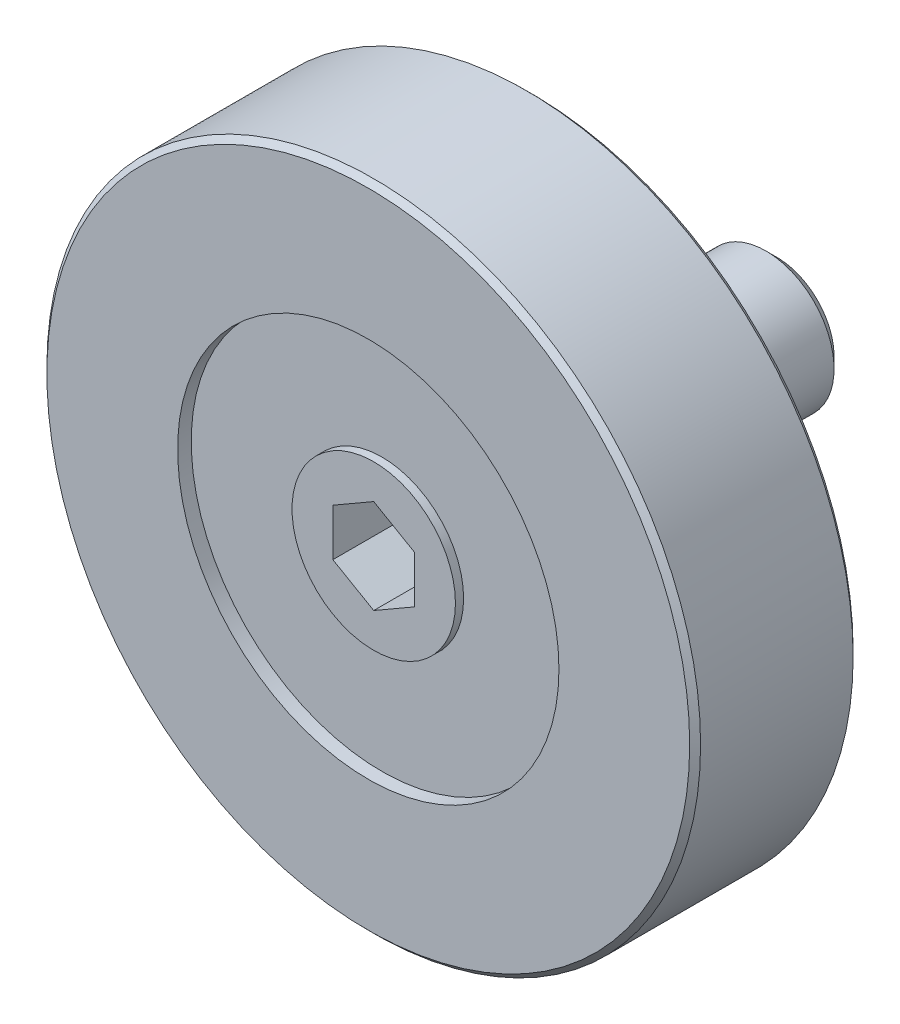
ISO-10303-21;
HEADER;
FILE_DESCRIPTION(('STEP AP214'),'2;1');
FILE_NAME('part.step','',(''),(''),'','','');
FILE_SCHEMA(('AUTOMOTIVE_DESIGN { 1 0 10303 214 1 1 1 1 }'));
ENDSEC;
DATA;
#1=APPLICATION_CONTEXT('core data for automotive mechanical design processes');
#2=APPLICATION_PROTOCOL_DEFINITION('international standard','automotive_design',2000,#1);
#3=PRODUCT_CONTEXT('',#1,'mechanical');
#4=PRODUCT('Part','Part','',(#3));
#5=PRODUCT_RELATED_PRODUCT_CATEGORY('part','',(#4));
#6=PRODUCT_DEFINITION_FORMATION('','',#4);
#7=PRODUCT_DEFINITION_CONTEXT('part definition',#1,'design');
#8=PRODUCT_DEFINITION('design','',#6,#7);
#9=PRODUCT_DEFINITION_SHAPE('','',#8);
#10=(LENGTH_UNIT() NAMED_UNIT(*) SI_UNIT(.MILLI.,.METRE.));
#11=(NAMED_UNIT(*) PLANE_ANGLE_UNIT() SI_UNIT($,.RADIAN.));
#12=(NAMED_UNIT(*) SI_UNIT($,.STERADIAN.) SOLID_ANGLE_UNIT());
#13=UNCERTAINTY_MEASURE_WITH_UNIT(LENGTH_MEASURE(1.E-05),#10,'distance_accuracy_value','');
#14=(GEOMETRIC_REPRESENTATION_CONTEXT(3) GLOBAL_UNCERTAINTY_ASSIGNED_CONTEXT((#13)) GLOBAL_UNIT_ASSIGNED_CONTEXT((#10,
#11,#12)) REPRESENTATION_CONTEXT('',''));
#15=CARTESIAN_POINT('',(0.,0.,0.));
#16=DIRECTION('',(0.,0.,1.));
#17=DIRECTION('',(1.,0.,0.));
#18=AXIS2_PLACEMENT_3D('',#15,#16,#17);
#19=CARTESIAN_POINT('',(0.,3.99999999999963,-3.05311331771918E-13));
#20=DIRECTION('',(0.,0.,1.));
#21=DIRECTION('',(1.,0.,0.));
#22=AXIS2_PLACEMENT_3D('',#19,#20,#21);
#23=PLANE('',#22);
#24=CARTESIAN_POINT('',(0.,0.,-3.05311331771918E-13));
#25=DIRECTION('',(0.,0.,1.));
#26=DIRECTION('',(1.,0.,0.));
#27=AXIS2_PLACEMENT_3D('',#24,#25,#26);
#28=CIRCLE('',#27,3.99999999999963);
#29=CARTESIAN_POINT('',(3.99999999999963,0.,-3.05311331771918E-13));
#30=VERTEX_POINT('',#29);
#31=EDGE_CURVE('E9',#30,#30,#28,.T.);
#32=ORIENTED_EDGE('',*,*,#31,.F.);
#33=EDGE_LOOP('',(#32));
#34=FACE_BOUND('',#33,.T.);
#35=CARTESIAN_POINT('',(0.,0.,-3.05311331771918E-13));
#36=DIRECTION('',(0.,0.,-1.));
#37=DIRECTION('',(-1.,0.,0.));
#38=AXIS2_PLACEMENT_3D('',#35,#36,#37);
#39=CIRCLE('',#38,2.);
#40=CARTESIAN_POINT('',(-2.,0.,-3.05311331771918E-13));
#41=VERTEX_POINT('',#40);
#42=EDGE_CURVE('E104',#41,#41,#39,.T.);
#43=ORIENTED_EDGE('',*,*,#42,.F.);
#44=EDGE_LOOP('',(#43));
#45=FACE_BOUND('',#44,.T.);
#46=ADVANCED_FACE('F14',(#34,#45),#23,.F.);
#47=CARTESIAN_POINT('',(0.,0.,10.));
#48=DIRECTION('',(0.,0.,1.));
#49=DIRECTION('',(1.,0.,0.));
#50=AXIS2_PLACEMENT_3D('',#47,#48,#49);
#51=CYLINDRICAL_SURFACE('',#50,3.99999999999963);
#52=CARTESIAN_POINT('',(0.,0.,1.49999999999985));
#53=DIRECTION('',(0.,0.,1.));
#54=DIRECTION('',(1.,0.,0.));
#55=AXIS2_PLACEMENT_3D('',#52,#53,#54);
#56=CIRCLE('',#55,3.99999999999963);
#57=CARTESIAN_POINT('',(3.99999999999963,0.,1.49999999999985));
#58=VERTEX_POINT('',#57);
#59=EDGE_CURVE('E22',#58,#58,#56,.T.);
#60=ORIENTED_EDGE('',*,*,#59,.F.);
#61=EDGE_LOOP('',(#60));
#62=FACE_BOUND('',#61,.T.);
#63=ORIENTED_EDGE('',*,*,#31,.T.);
#64=EDGE_LOOP('',(#63));
#65=FACE_BOUND('',#64,.T.);
#66=ADVANCED_FACE('F156',(#62,#65),#51,.T.);
#67=CARTESIAN_POINT('',(0.,3.99999999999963,1.49999999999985));
#68=DIRECTION('',(0.,0.,1.));
#69=DIRECTION('',(1.,0.,0.));
#70=AXIS2_PLACEMENT_3D('',#67,#68,#69);
#71=PLANE('',#70);
#72=CARTESIAN_POINT('',(0.,0.,1.49999999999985));
#73=DIRECTION('',(0.,0.,1.));
#74=DIRECTION('',(1.,0.,0.));
#75=AXIS2_PLACEMENT_3D('',#72,#73,#74);
#76=CIRCLE('',#75,6.99999999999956);
#77=CARTESIAN_POINT('',(6.99999999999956,0.,1.49999999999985));
#78=VERTEX_POINT('',#77);
#79=EDGE_CURVE('E149',#78,#78,#76,.T.);
#80=ORIENTED_EDGE('',*,*,#79,.F.);
#81=EDGE_LOOP('',(#80));
#82=FACE_BOUND('',#81,.T.);
#83=ORIENTED_EDGE('',*,*,#59,.T.);
#84=EDGE_LOOP('',(#83));
#85=FACE_BOUND('',#84,.T.);
#86=ADVANCED_FACE('F154',(#82,#85),#71,.F.);
#87=CARTESIAN_POINT('',(0.,0.,10.));
#88=DIRECTION('',(0.,0.,1.));
#89=DIRECTION('',(1.,0.,0.));
#90=AXIS2_PLACEMENT_3D('',#87,#88,#89);
#91=CYLINDRICAL_SURFACE('',#90,6.99999999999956);
#92=CARTESIAN_POINT('',(0.,0.,0.999999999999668));
#93=DIRECTION('',(0.,0.,1.));
#94=DIRECTION('',(1.,0.,0.));
#95=AXIS2_PLACEMENT_3D('',#92,#93,#94);
#96=CIRCLE('',#95,6.99999999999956);
#97=CARTESIAN_POINT('',(6.99999999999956,0.,0.999999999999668));
#98=VERTEX_POINT('',#97);
#99=EDGE_CURVE('E146',#98,#98,#96,.T.);
#100=ORIENTED_EDGE('',*,*,#99,.F.);
#101=EDGE_LOOP('',(#100));
#102=FACE_BOUND('',#101,.T.);
#103=ORIENTED_EDGE('',*,*,#79,.T.);
#104=EDGE_LOOP('',(#103));
#105=FACE_BOUND('',#104,.T.);
#106=ADVANCED_FACE('F237',(#102,#105),#91,.F.);
#107=CARTESIAN_POINT('',(0.,11.8,0.999999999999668));
#108=DIRECTION('',(0.,0.,1.));
#109=DIRECTION('',(1.,0.,0.));
#110=AXIS2_PLACEMENT_3D('',#107,#108,#109);
#111=PLANE('',#110);
#112=CARTESIAN_POINT('',(0.,0.,0.999999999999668));
#113=DIRECTION('',(0.,0.,1.));
#114=DIRECTION('',(1.,0.,0.));
#115=AXIS2_PLACEMENT_3D('',#112,#113,#114);
#116=CIRCLE('',#115,11.8);
#117=CARTESIAN_POINT('',(11.8,0.,0.999999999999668));
#118=VERTEX_POINT('',#117);
#119=EDGE_CURVE('E143',#118,#118,#116,.T.);
#120=ORIENTED_EDGE('',*,*,#119,.F.);
#121=EDGE_LOOP('',(#120));
#122=FACE_BOUND('',#121,.T.);
#123=ORIENTED_EDGE('',*,*,#99,.T.);
#124=EDGE_LOOP('',(#123));
#125=FACE_BOUND('',#124,.T.);
#126=ADVANCED_FACE('F233',(#122,#125),#111,.F.);
#127=CARTESIAN_POINT('',(0.,0.,0.999999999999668));
#128=DIRECTION('',(0.,0.,1.));
#129=DIRECTION('',(1.,0.,0.));
#130=AXIS2_PLACEMENT_3D('',#127,#128,#129);
#131=CONICAL_SURFACE('',#130,11.8,0.785398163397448);
#132=CARTESIAN_POINT('',(0.,0.,1.19999999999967));
#133=DIRECTION('',(0.,0.,1.));
#134=DIRECTION('',(1.,0.,0.));
#135=AXIS2_PLACEMENT_3D('',#132,#133,#134);
#136=CIRCLE('',#135,12.);
#137=CARTESIAN_POINT('',(12.,0.,1.19999999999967));
#138=VERTEX_POINT('',#137);
#139=EDGE_CURVE('E140',#138,#138,#136,.T.);
#140=ORIENTED_EDGE('',*,*,#139,.F.);
#141=EDGE_LOOP('',(#140));
#142=FACE_BOUND('',#141,.T.);
#143=ORIENTED_EDGE('',*,*,#119,.T.);
#144=EDGE_LOOP('',(#143));
#145=FACE_BOUND('',#144,.T.);
#146=ADVANCED_FACE('F229',(#142,#145),#131,.T.);
#147=CARTESIAN_POINT('',(0.,0.,10.));
#148=DIRECTION('',(0.,0.,1.));
#149=DIRECTION('',(1.,0.,0.));
#150=AXIS2_PLACEMENT_3D('',#147,#148,#149);
#151=CYLINDRICAL_SURFACE('',#150,12.);
#152=CARTESIAN_POINT('',(0.,0.,6.8));
#153=DIRECTION('',(0.,0.,1.));
#154=DIRECTION('',(1.,0.,0.));
#155=AXIS2_PLACEMENT_3D('',#152,#153,#154);
#156=CIRCLE('',#155,12.);
#157=CARTESIAN_POINT('',(12.,0.,6.8));
#158=VERTEX_POINT('',#157);
#159=EDGE_CURVE('E137',#158,#158,#156,.T.);
#160=ORIENTED_EDGE('',*,*,#159,.F.);
#161=EDGE_LOOP('',(#160));
#162=FACE_BOUND('',#161,.T.);
#163=ORIENTED_EDGE('',*,*,#139,.T.);
#164=EDGE_LOOP('',(#163));
#165=FACE_BOUND('',#164,.T.);
#166=ADVANCED_FACE('F225',(#162,#165),#151,.T.);
#167=CARTESIAN_POINT('',(0.,0.,6.8));
#168=DIRECTION('',(0.,0.,-1.));
#169=DIRECTION('',(-1.,0.,0.));
#170=AXIS2_PLACEMENT_3D('',#167,#168,#169);
#171=CONICAL_SURFACE('',#170,12.,0.78539816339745);
#172=CARTESIAN_POINT('',(0.,0.,7.));
#173=DIRECTION('',(0.,0.,1.));
#174=DIRECTION('',(1.,0.,0.));
#175=AXIS2_PLACEMENT_3D('',#172,#173,#174);
#176=CIRCLE('',#175,11.8);
#177=CARTESIAN_POINT('',(11.8,0.,7.));
#178=VERTEX_POINT('',#177);
#179=EDGE_CURVE('E134',#178,#178,#176,.T.);
#180=ORIENTED_EDGE('',*,*,#179,.F.);
#181=EDGE_LOOP('',(#180));
#182=FACE_BOUND('',#181,.T.);
#183=ORIENTED_EDGE('',*,*,#159,.T.);
#184=EDGE_LOOP('',(#183));
#185=FACE_BOUND('',#184,.T.);
#186=ADVANCED_FACE('F221',(#182,#185),#171,.T.);
#187=CARTESIAN_POINT('',(0.,11.8,7.));
#188=DIRECTION('',(0.,0.,-1.));
#189=DIRECTION('',(-1.,0.,0.));
#190=AXIS2_PLACEMENT_3D('',#187,#188,#189);
#191=PLANE('',#190);
#192=CARTESIAN_POINT('',(0.,0.,7.));
#193=DIRECTION('',(0.,0.,1.));
#194=DIRECTION('',(1.,0.,0.));
#195=AXIS2_PLACEMENT_3D('',#192,#193,#194);
#196=CIRCLE('',#195,6.99999999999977);
#197=CARTESIAN_POINT('',(6.99999999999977,0.,7.));
#198=VERTEX_POINT('',#197);
#199=EDGE_CURVE('E131',#198,#198,#196,.T.);
#200=ORIENTED_EDGE('',*,*,#199,.F.);
#201=EDGE_LOOP('',(#200));
#202=FACE_BOUND('',#201,.T.);
#203=ORIENTED_EDGE('',*,*,#179,.T.);
#204=EDGE_LOOP('',(#203));
#205=FACE_BOUND('',#204,.T.);
#206=ADVANCED_FACE('F217',(#202,#205),#191,.F.);
#207=CARTESIAN_POINT('',(0.,0.,10.));
#208=DIRECTION('',(0.,0.,1.));
#209=DIRECTION('',(1.,0.,0.));
#210=AXIS2_PLACEMENT_3D('',#207,#208,#209);
#211=CYLINDRICAL_SURFACE('',#210,6.99999999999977);
#212=CARTESIAN_POINT('',(0.,0.,6.5));
#213=DIRECTION('',(0.,0.,1.));
#214=DIRECTION('',(1.,0.,0.));
#215=AXIS2_PLACEMENT_3D('',#212,#213,#214);
#216=CIRCLE('',#215,6.99999999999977);
#217=CARTESIAN_POINT('',(6.99999999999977,0.,6.5));
#218=VERTEX_POINT('',#217);
#219=EDGE_CURVE('E128',#218,#218,#216,.T.);
#220=ORIENTED_EDGE('',*,*,#219,.F.);
#221=EDGE_LOOP('',(#220));
#222=FACE_BOUND('',#221,.T.);
#223=ORIENTED_EDGE('',*,*,#199,.T.);
#224=EDGE_LOOP('',(#223));
#225=FACE_BOUND('',#224,.T.);
#226=ADVANCED_FACE('F213',(#222,#225),#211,.F.);
#227=CARTESIAN_POINT('',(0.,3.,6.5));
#228=DIRECTION('',(0.,0.,-1.));
#229=DIRECTION('',(-1.,0.,0.));
#230=AXIS2_PLACEMENT_3D('',#227,#228,#229);
#231=PLANE('',#230);
#232=CARTESIAN_POINT('',(0.,0.,6.5));
#233=DIRECTION('',(0.,0.,1.));
#234=DIRECTION('',(1.,0.,0.));
#235=AXIS2_PLACEMENT_3D('',#232,#233,#234);
#236=CIRCLE('',#235,3.);
#237=CARTESIAN_POINT('',(3.,0.,6.5));
#238=VERTEX_POINT('',#237);
#239=EDGE_CURVE('E125',#238,#238,#236,.T.);
#240=ORIENTED_EDGE('',*,*,#239,.F.);
#241=EDGE_LOOP('',(#240));
#242=FACE_BOUND('',#241,.T.);
#243=ORIENTED_EDGE('',*,*,#219,.T.);
#244=EDGE_LOOP('',(#243));
#245=FACE_BOUND('',#244,.T.);
#246=ADVANCED_FACE('F209',(#242,#245),#231,.F.);
#247=CARTESIAN_POINT('',(0.,0.,10.));
#248=DIRECTION('',(0.,0.,1.));
#249=DIRECTION('',(1.,0.,0.));
#250=AXIS2_PLACEMENT_3D('',#247,#248,#249);
#251=CYLINDRICAL_SURFACE('',#250,3.);
#252=CARTESIAN_POINT('',(0.,0.,6.8));
#253=DIRECTION('',(0.,0.,1.));
#254=DIRECTION('',(1.,0.,0.));
#255=AXIS2_PLACEMENT_3D('',#252,#253,#254);
#256=CIRCLE('',#255,3.);
#257=CARTESIAN_POINT('',(3.,0.,6.8));
#258=VERTEX_POINT('',#257);
#259=EDGE_CURVE('E117',#258,#258,#256,.T.);
#260=ORIENTED_EDGE('',*,*,#259,.F.);
#261=EDGE_LOOP('',(#260));
#262=FACE_BOUND('',#261,.T.);
#263=ORIENTED_EDGE('',*,*,#239,.T.);
#264=EDGE_LOOP('',(#263));
#265=FACE_BOUND('',#264,.T.);
#266=ADVANCED_FACE('F206',(#262,#265),#251,.T.);
#267=CARTESIAN_POINT('',(0.,3.,6.8));
#268=DIRECTION('',(0.,0.,-1.));
#269=DIRECTION('',(-1.,0.,0.));
#270=AXIS2_PLACEMENT_3D('',#267,#268,#269);
#271=PLANE('',#270);
#272=DIRECTION('',(-0.866025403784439,-0.5,0.));
#273=VECTOR('',#272,1.);
#274=CARTESIAN_POINT('',(0.,1.73205080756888,6.8));
#275=LINE('',#274,#273);
#276=CARTESIAN_POINT('',(0.,1.73205080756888,6.8));
#277=VERTEX_POINT('',#276);
#278=CARTESIAN_POINT('',(-1.5,0.86602540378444,6.8));
#279=VERTEX_POINT('',#278);
#280=EDGE_CURVE('E103',#277,#279,#275,.T.);
#281=ORIENTED_EDGE('',*,*,#280,.F.);
#282=DIRECTION('',(-0.866025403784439,0.5,0.));
#283=VECTOR('',#282,1.);
#284=CARTESIAN_POINT('',(1.5,0.86602540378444,6.8));
#285=LINE('',#284,#283);
#286=CARTESIAN_POINT('',(1.5,0.86602540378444,6.8));
#287=VERTEX_POINT('',#286);
#288=EDGE_CURVE('E29',#287,#277,#285,.T.);
#289=ORIENTED_EDGE('',*,*,#288,.F.);
#290=DIRECTION('',(0.,1.,0.));
#291=VECTOR('',#290,1.);
#292=CARTESIAN_POINT('',(1.5,-0.866025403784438,6.8));
#293=LINE('',#292,#291);
#294=CARTESIAN_POINT('',(1.5,-0.866025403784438,6.8));
#295=VERTEX_POINT('',#294);
#296=EDGE_CURVE('E113',#295,#287,#293,.T.);
#297=ORIENTED_EDGE('',*,*,#296,.F.);
#298=DIRECTION('',(0.866025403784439,0.5,0.));
#299=VECTOR('',#298,1.);
#300=CARTESIAN_POINT('',(0.,-1.73205080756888,6.8));
#301=LINE('',#300,#299);
#302=CARTESIAN_POINT('',(0.,-1.73205080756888,6.8));
#303=VERTEX_POINT('',#302);
#304=EDGE_CURVE('E111',#303,#295,#301,.T.);
#305=ORIENTED_EDGE('',*,*,#304,.F.);
#306=DIRECTION('',(0.866025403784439,-0.5,0.));
#307=VECTOR('',#306,1.);
#308=CARTESIAN_POINT('',(-1.5,-0.866025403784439,6.8));
#309=LINE('',#308,#307);
#310=CARTESIAN_POINT('',(-1.5,-0.866025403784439,6.8));
#311=VERTEX_POINT('',#310);
#312=EDGE_CURVE('E77',#311,#303,#309,.T.);
#313=ORIENTED_EDGE('',*,*,#312,.F.);
#314=DIRECTION('',(0.,-1.,0.));
#315=VECTOR('',#314,1.);
#316=CARTESIAN_POINT('',(-1.5,0.86602540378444,6.8));
#317=LINE('',#316,#315);
#318=EDGE_CURVE('E107',#279,#311,#317,.T.);
#319=ORIENTED_EDGE('',*,*,#318,.F.);
#320=EDGE_LOOP('',(#281,#289,#297,#305,#313,#319));
#321=FACE_BOUND('',#320,.T.);
#322=ORIENTED_EDGE('',*,*,#259,.T.);
#323=EDGE_LOOP('',(#322));
#324=FACE_BOUND('',#323,.T.);
#325=ADVANCED_FACE('F181',(#321,#324),#271,.F.);
#326=CARTESIAN_POINT('',(1.5,0.86602540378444,4.3));
#327=DIRECTION('',(0.5,0.866025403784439,0.));
#328=DIRECTION('',(-0.866025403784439,0.5,0.));
#329=AXIS2_PLACEMENT_3D('',#326,#327,#328);
#330=PLANE('',#329);
#331=ORIENTED_EDGE('',*,*,#288,.T.);
#332=DIRECTION('',(0.,0.,1.));
#333=VECTOR('',#332,1.);
#334=CARTESIAN_POINT('',(0.,1.73205080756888,4.3));
#335=LINE('',#334,#333);
#336=CARTESIAN_POINT('',(0.,1.73205080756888,4.3));
#337=VERTEX_POINT('',#336);
#338=EDGE_CURVE('E59',#337,#277,#335,.T.);
#339=ORIENTED_EDGE('',*,*,#338,.F.);
#340=DIRECTION('',(-0.866025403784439,0.5,0.));
#341=VECTOR('',#340,1.);
#342=CARTESIAN_POINT('',(1.5,0.86602540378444,4.3));
#343=LINE('',#342,#341);
#344=CARTESIAN_POINT('',(1.5,0.86602540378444,4.3));
#345=VERTEX_POINT('',#344);
#346=EDGE_CURVE('E115',#345,#337,#343,.T.);
#347=ORIENTED_EDGE('',*,*,#346,.F.);
#348=DIRECTION('',(0.,0.,1.));
#349=VECTOR('',#348,1.);
#350=CARTESIAN_POINT('',(1.5,0.86602540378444,4.3));
#351=LINE('',#350,#349);
#352=EDGE_CURVE('E37',#345,#287,#351,.T.);
#353=ORIENTED_EDGE('',*,*,#352,.T.);
#354=EDGE_LOOP('',(#331,#339,#347,#353));
#355=FACE_BOUND('',#354,.T.);
#356=ADVANCED_FACE('F186',(#355),#330,.F.);
#357=CARTESIAN_POINT('',(1.5,-0.866025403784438,4.3));
#358=DIRECTION('',(1.,0.,0.));
#359=DIRECTION('',(0.,1.,0.));
#360=AXIS2_PLACEMENT_3D('',#357,#358,#359);
#361=PLANE('',#360);
#362=ORIENTED_EDGE('',*,*,#296,.T.);
#363=ORIENTED_EDGE('',*,*,#352,.F.);
#364=DIRECTION('',(0.,1.,0.));
#365=VECTOR('',#364,1.);
#366=CARTESIAN_POINT('',(1.5,-0.866025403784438,4.3));
#367=LINE('',#366,#365);
#368=CARTESIAN_POINT('',(1.5,-0.866025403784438,4.3));
#369=VERTEX_POINT('',#368);
#370=EDGE_CURVE('E89',#369,#345,#367,.T.);
#371=ORIENTED_EDGE('',*,*,#370,.F.);
#372=DIRECTION('',(0.,0.,1.));
#373=VECTOR('',#372,1.);
#374=CARTESIAN_POINT('',(1.5,-0.866025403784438,4.3));
#375=LINE('',#374,#373);
#376=EDGE_CURVE('E81',#369,#295,#375,.T.);
#377=ORIENTED_EDGE('',*,*,#376,.T.);
#378=EDGE_LOOP('',(#362,#363,#371,#377));
#379=FACE_BOUND('',#378,.T.);
#380=ADVANCED_FACE('F184',(#379),#361,.F.);
#381=CARTESIAN_POINT('',(0.,-1.73205080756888,4.3));
#382=DIRECTION('',(0.5,-0.866025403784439,0.));
#383=DIRECTION('',(0.866025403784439,0.5,0.));
#384=AXIS2_PLACEMENT_3D('',#381,#382,#383);
#385=PLANE('',#384);
#386=ORIENTED_EDGE('',*,*,#304,.T.);
#387=ORIENTED_EDGE('',*,*,#376,.F.);
#388=DIRECTION('',(0.866025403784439,0.5,0.));
#389=VECTOR('',#388,1.);
#390=CARTESIAN_POINT('',(0.,-1.73205080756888,4.3));
#391=LINE('',#390,#389);
#392=CARTESIAN_POINT('',(0.,-1.73205080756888,4.3));
#393=VERTEX_POINT('',#392);
#394=EDGE_CURVE('E85',#393,#369,#391,.T.);
#395=ORIENTED_EDGE('',*,*,#394,.F.);
#396=DIRECTION('',(0.,0.,1.));
#397=VECTOR('',#396,1.);
#398=CARTESIAN_POINT('',(0.,-1.73205080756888,4.3));
#399=LINE('',#398,#397);
#400=EDGE_CURVE('E70',#393,#303,#399,.T.);
#401=ORIENTED_EDGE('',*,*,#400,.T.);
#402=EDGE_LOOP('',(#386,#387,#395,#401));
#403=FACE_BOUND('',#402,.T.);
#404=ADVANCED_FACE('F86',(#403),#385,.F.);
#405=CARTESIAN_POINT('',(-1.5,-0.866025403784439,4.3));
#406=DIRECTION('',(-0.5,-0.866025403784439,0.));
#407=DIRECTION('',(0.866025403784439,-0.5,0.));
#408=AXIS2_PLACEMENT_3D('',#405,#406,#407);
#409=PLANE('',#408);
#410=ORIENTED_EDGE('',*,*,#312,.T.);
#411=ORIENTED_EDGE('',*,*,#400,.F.);
#412=DIRECTION('',(0.866025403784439,-0.5,0.));
#413=VECTOR('',#412,1.);
#414=CARTESIAN_POINT('',(-1.5,-0.866025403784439,4.3));
#415=LINE('',#414,#413);
#416=CARTESIAN_POINT('',(-1.5,-0.866025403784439,4.3));
#417=VERTEX_POINT('',#416);
#418=EDGE_CURVE('E74',#417,#393,#415,.T.);
#419=ORIENTED_EDGE('',*,*,#418,.F.);
#420=DIRECTION('',(0.,0.,1.));
#421=VECTOR('',#420,1.);
#422=CARTESIAN_POINT('',(-1.5,-0.866025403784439,4.3));
#423=LINE('',#422,#421);
#424=EDGE_CURVE('E82',#417,#311,#423,.T.);
#425=ORIENTED_EDGE('',*,*,#424,.T.);
#426=EDGE_LOOP('',(#410,#411,#419,#425));
#427=FACE_BOUND('',#426,.T.);
#428=ADVANCED_FACE('F72',(#427),#409,.F.);
#429=CARTESIAN_POINT('',(-1.5,0.86602540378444,4.3));
#430=DIRECTION('',(-1.,0.,0.));
#431=DIRECTION('',(0.,-1.,0.));
#432=AXIS2_PLACEMENT_3D('',#429,#430,#431);
#433=PLANE('',#432);
#434=ORIENTED_EDGE('',*,*,#318,.T.);
#435=ORIENTED_EDGE('',*,*,#424,.F.);
#436=DIRECTION('',(0.,-1.,0.));
#437=VECTOR('',#436,1.);
#438=CARTESIAN_POINT('',(-1.5,0.86602540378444,4.3));
#439=LINE('',#438,#437);
#440=CARTESIAN_POINT('',(-1.5,0.86602540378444,4.3));
#441=VERTEX_POINT('',#440);
#442=EDGE_CURVE('E95',#441,#417,#439,.T.);
#443=ORIENTED_EDGE('',*,*,#442,.F.);
#444=DIRECTION('',(0.,0.,1.));
#445=VECTOR('',#444,1.);
#446=CARTESIAN_POINT('',(-1.5,0.86602540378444,4.3));
#447=LINE('',#446,#445);
#448=EDGE_CURVE('E120',#441,#279,#447,.T.);
#449=ORIENTED_EDGE('',*,*,#448,.T.);
#450=EDGE_LOOP('',(#434,#435,#443,#449));
#451=FACE_BOUND('',#450,.T.);
#452=ADVANCED_FACE('F179',(#451),#433,.F.);
#453=CARTESIAN_POINT('',(0.,1.73205080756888,4.3));
#454=DIRECTION('',(-0.5,0.866025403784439,0.));
#455=DIRECTION('',(-0.866025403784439,-0.5,0.));
#456=AXIS2_PLACEMENT_3D('',#453,#454,#455);
#457=PLANE('',#456);
#458=ORIENTED_EDGE('',*,*,#280,.T.);
#459=ORIENTED_EDGE('',*,*,#448,.F.);
#460=DIRECTION('',(-0.866025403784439,-0.5,0.));
#461=VECTOR('',#460,1.);
#462=CARTESIAN_POINT('',(0.,1.73205080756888,4.3));
#463=LINE('',#462,#461);
#464=EDGE_CURVE('E97',#337,#441,#463,.T.);
#465=ORIENTED_EDGE('',*,*,#464,.F.);
#466=ORIENTED_EDGE('',*,*,#338,.T.);
#467=EDGE_LOOP('',(#458,#459,#465,#466));
#468=FACE_BOUND('',#467,.T.);
#469=ADVANCED_FACE('F175',(#468),#457,.F.);
#470=CARTESIAN_POINT('',(0.,0.,4.3));
#471=DIRECTION('',(0.,0.,1.));
#472=DIRECTION('',(1.,0.,0.));
#473=AXIS2_PLACEMENT_3D('',#470,#471,#472);
#474=PLANE('',#473);
#475=ORIENTED_EDGE('',*,*,#346,.T.);
#476=ORIENTED_EDGE('',*,*,#464,.T.);
#477=ORIENTED_EDGE('',*,*,#442,.T.);
#478=ORIENTED_EDGE('',*,*,#418,.T.);
#479=ORIENTED_EDGE('',*,*,#394,.T.);
#480=ORIENTED_EDGE('',*,*,#370,.T.);
#481=EDGE_LOOP('',(#475,#476,#477,#478,#479,#480));
#482=FACE_BOUND('',#481,.T.);
#483=ADVANCED_FACE('F92',(#482),#474,.T.);
#484=CARTESIAN_POINT('',(0.,0.,-8.00000000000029));
#485=DIRECTION('',(0.,0.,-1.));
#486=DIRECTION('',(-1.,0.,0.));
#487=AXIS2_PLACEMENT_3D('',#484,#485,#486);
#488=CYLINDRICAL_SURFACE('',#487,2.);
#489=CARTESIAN_POINT('',(0.,0.,-1.60000000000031));
#490=DIRECTION('',(0.,0.,-1.));
#491=DIRECTION('',(-1.,0.,0.));
#492=AXIS2_PLACEMENT_3D('',#489,#490,#491);
#493=CIRCLE('',#492,2.);
#494=CARTESIAN_POINT('',(-2.,0.,-1.60000000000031));
#495=VERTEX_POINT('',#494);
#496=EDGE_CURVE('E167',#495,#495,#493,.T.);
#497=ORIENTED_EDGE('',*,*,#496,.F.);
#498=EDGE_LOOP('',(#497));
#499=FACE_BOUND('',#498,.T.);
#500=ORIENTED_EDGE('',*,*,#42,.T.);
#501=EDGE_LOOP('',(#500));
#502=FACE_BOUND('',#501,.T.);
#503=ADVANCED_FACE('F349',(#499,#502),#488,.T.);
#504=CARTESIAN_POINT('',(0.,2.,-1.60000000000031));
#505=DIRECTION('',(0.,0.,-1.));
#506=DIRECTION('',(-1.,0.,0.));
#507=AXIS2_PLACEMENT_3D('',#504,#505,#506);
#508=PLANE('',#507);
#509=CARTESIAN_POINT('',(0.,0.,-1.60000000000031));
#510=DIRECTION('',(0.,0.,-1.));
#511=DIRECTION('',(-1.,0.,0.));
#512=AXIS2_PLACEMENT_3D('',#509,#510,#511);
#513=CIRCLE('',#512,2.5);
#514=CARTESIAN_POINT('',(-2.5,0.,-1.60000000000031));
#515=VERTEX_POINT('',#514);
#516=EDGE_CURVE('E170',#515,#515,#513,.T.);
#517=ORIENTED_EDGE('',*,*,#516,.F.);
#518=EDGE_LOOP('',(#517));
#519=FACE_BOUND('',#518,.T.);
#520=ORIENTED_EDGE('',*,*,#496,.T.);
#521=EDGE_LOOP('',(#520));
#522=FACE_BOUND('',#521,.T.);
#523=ADVANCED_FACE('F358',(#519,#522),#508,.F.);
#524=CARTESIAN_POINT('',(0.,0.,-8.00000000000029));
#525=DIRECTION('',(0.,0.,-1.));
#526=DIRECTION('',(-1.,0.,0.));
#527=AXIS2_PLACEMENT_3D('',#524,#525,#526);
#528=CYLINDRICAL_SURFACE('',#527,2.5);
#529=CARTESIAN_POINT('',(0.,0.,-7.60000000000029));
#530=DIRECTION('',(0.,0.,-1.));
#531=DIRECTION('',(-1.,0.,0.));
#532=AXIS2_PLACEMENT_3D('',#529,#530,#531);
#533=CIRCLE('',#532,2.5);
#534=CARTESIAN_POINT('',(-2.5,0.,-7.60000000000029));
#535=VERTEX_POINT('',#534);
#536=EDGE_CURVE('E402',#535,#535,#533,.T.);
#537=ORIENTED_EDGE('',*,*,#536,.F.);
#538=EDGE_LOOP('',(#537));
#539=FACE_BOUND('',#538,.T.);
#540=ORIENTED_EDGE('',*,*,#516,.T.);
#541=EDGE_LOOP('',(#540));
#542=FACE_BOUND('',#541,.T.);
#543=ADVANCED_FACE('F367',(#539,#542),#528,.T.);
#544=CARTESIAN_POINT('',(0.,0.,-7.60000000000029));
#545=DIRECTION('',(0.,0.,1.));
#546=DIRECTION('',(1.,0.,0.));
#547=AXIS2_PLACEMENT_3D('',#544,#545,#546);
#548=CONICAL_SURFACE('',#547,2.5,0.785398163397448);
#549=CARTESIAN_POINT('',(0.,0.,-8.00000000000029));
#550=DIRECTION('',(0.,0.,-1.));
#551=DIRECTION('',(-1.,0.,0.));
#552=AXIS2_PLACEMENT_3D('',#549,#550,#551);
#553=CIRCLE('',#552,2.1);
#554=CARTESIAN_POINT('',(-2.1,0.,-8.00000000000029));
#555=VERTEX_POINT('',#554);
#556=EDGE_CURVE('E401',#555,#555,#553,.T.);
#557=ORIENTED_EDGE('',*,*,#556,.F.);
#558=EDGE_LOOP('',(#557));
#559=FACE_BOUND('',#558,.T.);
#560=ORIENTED_EDGE('',*,*,#536,.T.);
#561=EDGE_LOOP('',(#560));
#562=FACE_BOUND('',#561,.T.);
#563=ADVANCED_FACE('F377',(#559,#562),#548,.T.);
#564=CARTESIAN_POINT('',(0.,0.,-8.00000000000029));
#565=DIRECTION('',(0.,0.,1.));
#566=DIRECTION('',(1.,0.,0.));
#567=AXIS2_PLACEMENT_3D('',#564,#565,#566);
#568=PLANE('',#567);
#569=ORIENTED_EDGE('',*,*,#556,.T.);
#570=EDGE_LOOP('',(#569));
#571=FACE_BOUND('',#570,.T.);
#572=ADVANCED_FACE('F16',(#571),#568,.F.);
#573=CLOSED_SHELL('',(#46,#66,#86,#106,#126,#146,#166,#186,#206,#226,#246,#266,#325,#356,#380,
#404,#428,#452,#469,#483,#503,#523,#543,#563,#572));
#574=MANIFOLD_SOLID_BREP('B1',#573);
#575=ADVANCED_BREP_SHAPE_REPRESENTATION('',(#18,#574),#14);
#576=SHAPE_DEFINITION_REPRESENTATION(#9,#575);
ENDSEC;
END-ISO-10303-21;
